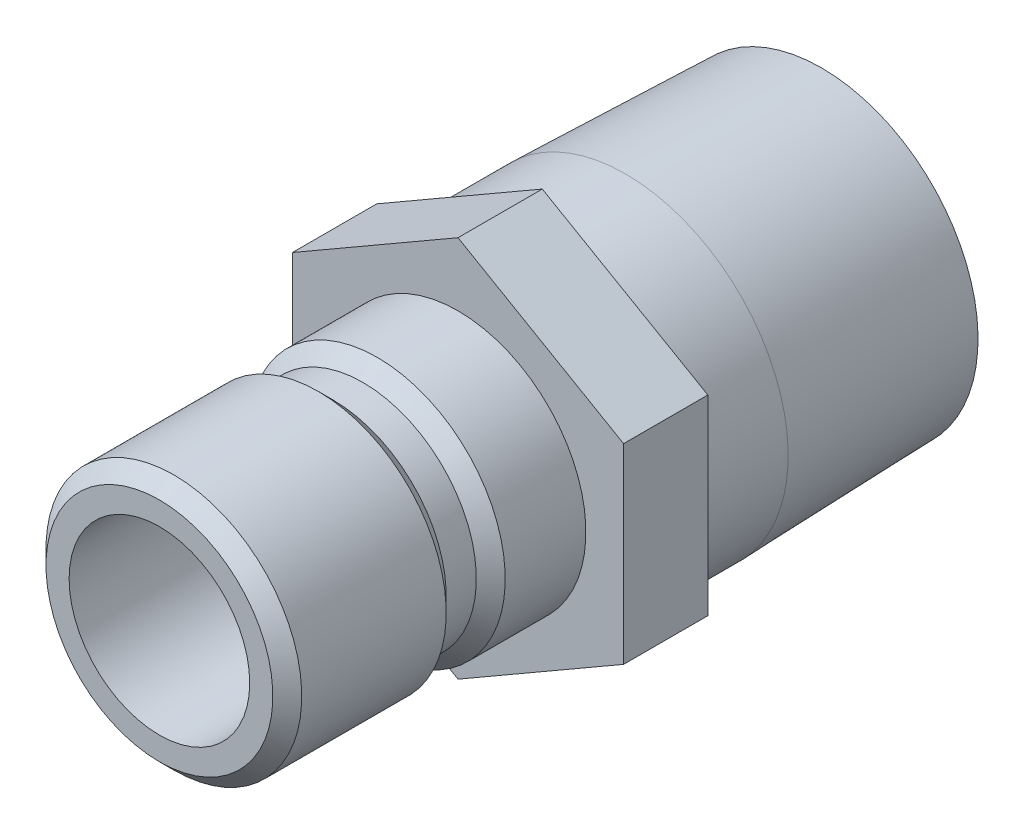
ISO-10303-21;
HEADER;
FILE_DESCRIPTION(('STEP AP214'),'2;1');
FILE_NAME('part.step','',(''),(''),'','','');
FILE_SCHEMA(('AUTOMOTIVE_DESIGN { 1 0 10303 214 1 1 1 1 }'));
ENDSEC;
DATA;
#1=APPLICATION_CONTEXT('core data for automotive mechanical design processes');
#2=APPLICATION_PROTOCOL_DEFINITION('international standard','automotive_design',2000,#1);
#3=PRODUCT_CONTEXT('',#1,'mechanical');
#4=PRODUCT('Part','Part','',(#3));
#5=PRODUCT_RELATED_PRODUCT_CATEGORY('part','',(#4));
#6=PRODUCT_DEFINITION_FORMATION('','',#4);
#7=PRODUCT_DEFINITION_CONTEXT('part definition',#1,'design');
#8=PRODUCT_DEFINITION('design','',#6,#7);
#9=PRODUCT_DEFINITION_SHAPE('','',#8);
#10=(LENGTH_UNIT() NAMED_UNIT(*) SI_UNIT(.MILLI.,.METRE.));
#11=(NAMED_UNIT(*) PLANE_ANGLE_UNIT() SI_UNIT($,.RADIAN.));
#12=(NAMED_UNIT(*) SI_UNIT($,.STERADIAN.) SOLID_ANGLE_UNIT());
#13=UNCERTAINTY_MEASURE_WITH_UNIT(LENGTH_MEASURE(1.E-05),#10,'distance_accuracy_value','');
#14=(GEOMETRIC_REPRESENTATION_CONTEXT(3) GLOBAL_UNCERTAINTY_ASSIGNED_CONTEXT((#13)) GLOBAL_UNIT_ASSIGNED_CONTEXT((#10,
#11,#12)) REPRESENTATION_CONTEXT('',''));
#15=CARTESIAN_POINT('',(0.,0.,0.));
#16=DIRECTION('',(0.,0.,1.));
#17=DIRECTION('',(1.,0.,0.));
#18=AXIS2_PLACEMENT_3D('',#15,#16,#17);
#19=CARTESIAN_POINT('',(0.,0.,0.));
#20=DIRECTION('',(0.,0.,-1.));
#21=DIRECTION('',(0.,1.,0.));
#22=AXIS2_PLACEMENT_3D('',#19,#20,#21);
#23=CYLINDRICAL_SURFACE('',#22,8.5725);
#24=CARTESIAN_POINT('',(0.,0.,-8.8392));
#25=DIRECTION('',(0.,0.,-1.));
#26=DIRECTION('',(0.,1.,0.));
#27=AXIS2_PLACEMENT_3D('',#24,#25,#26);
#28=CIRCLE('',#27,8.5725);
#29=CARTESIAN_POINT('',(0.,8.5725,-8.8392));
#30=VERTEX_POINT('',#29);
#31=EDGE_CURVE('E158',#30,#30,#28,.T.);
#32=ORIENTED_EDGE('',*,*,#31,.F.);
#33=EDGE_LOOP('',(#32));
#34=FACE_BOUND('',#33,.T.);
#35=CARTESIAN_POINT('',(0.,0.,-4.445));
#36=DIRECTION('',(0.,0.,1.));
#37=DIRECTION('',(1.,0.,0.));
#38=AXIS2_PLACEMENT_3D('',#35,#36,#37);
#39=CIRCLE('',#38,8.5725);
#40=CARTESIAN_POINT('',(8.5725,0.,-4.445));
#41=VERTEX_POINT('',#40);
#42=EDGE_CURVE('E138',#41,#41,#39,.F.);
#43=ORIENTED_EDGE('',*,*,#42,.T.);
#44=EDGE_LOOP('',(#43));
#45=FACE_BOUND('',#44,.T.);
#46=ADVANCED_FACE('F33',(#34,#45),#23,.T.);
#47=CARTESIAN_POINT('',(0.,0.,0.));
#48=DIRECTION('',(0.,0.,-1.));
#49=DIRECTION('',(0.,1.,0.));
#50=AXIS2_PLACEMENT_3D('',#47,#48,#49);
#51=CYLINDRICAL_SURFACE('',#50,4.7625);
#52=CARTESIAN_POINT('',(0.,0.,-0.127000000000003));
#53=DIRECTION('',(0.,0.,-1.));
#54=DIRECTION('',(0.,1.,0.));
#55=AXIS2_PLACEMENT_3D('',#52,#53,#54);
#56=CIRCLE('',#55,4.7625);
#57=CARTESIAN_POINT('',(0.,4.7625,-0.127000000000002));
#58=VERTEX_POINT('',#57);
#59=EDGE_CURVE('E146',#58,#58,#56,.T.);
#60=ORIENTED_EDGE('',*,*,#59,.T.);
#61=EDGE_LOOP('',(#60));
#62=FACE_BOUND('',#61,.T.);
#63=CARTESIAN_POINT('',(0.,0.,15.748));
#64=DIRECTION('',(0.,0.,-1.));
#65=DIRECTION('',(0.,1.,0.));
#66=AXIS2_PLACEMENT_3D('',#63,#64,#65);
#67=CIRCLE('',#66,4.7625);
#68=CARTESIAN_POINT('',(0.,4.7625,15.748));
#69=VERTEX_POINT('',#68);
#70=EDGE_CURVE('E11',#69,#69,#67,.T.);
#71=ORIENTED_EDGE('',*,*,#70,.F.);
#72=EDGE_LOOP('',(#71));
#73=FACE_BOUND('',#72,.T.);
#74=ADVANCED_FACE('F35',(#62,#73),#51,.F.);
#75=CARTESIAN_POINT('',(0.,4.7625,15.748));
#76=DIRECTION('',(0.,0.,1.));
#77=DIRECTION('',(0.,-1.,0.));
#78=AXIS2_PLACEMENT_3D('',#75,#76,#77);
#79=PLANE('',#78);
#80=ORIENTED_EDGE('',*,*,#70,.T.);
#81=EDGE_LOOP('',(#80));
#82=FACE_BOUND('',#81,.T.);
#83=CARTESIAN_POINT('',(0.,0.,15.748));
#84=DIRECTION('',(0.,0.,-1.));
#85=DIRECTION('',(0.,1.,0.));
#86=AXIS2_PLACEMENT_3D('',#83,#84,#85);
#87=CIRCLE('',#86,5.9817);
#88=CARTESIAN_POINT('',(0.,5.9817,15.748));
#89=VERTEX_POINT('',#88);
#90=EDGE_CURVE('E42',#89,#89,#87,.T.);
#91=ORIENTED_EDGE('',*,*,#90,.F.);
#92=EDGE_LOOP('',(#91));
#93=FACE_BOUND('',#92,.T.);
#94=ADVANCED_FACE('F184',(#82,#93),#79,.T.);
#95=CARTESIAN_POINT('',(0.,0.,14.986));
#96=DIRECTION('',(0.,0.,-1.));
#97=DIRECTION('',(0.,1.,0.));
#98=AXIS2_PLACEMENT_3D('',#95,#96,#97);
#99=CONICAL_SURFACE('',#98,6.7437,0.785398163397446);
#100=ORIENTED_EDGE('',*,*,#90,.T.);
#101=EDGE_LOOP('',(#100));
#102=FACE_BOUND('',#101,.T.);
#103=CARTESIAN_POINT('',(0.,0.,14.986));
#104=DIRECTION('',(0.,0.,-1.));
#105=DIRECTION('',(0.,1.,0.));
#106=AXIS2_PLACEMENT_3D('',#103,#104,#105);
#107=CIRCLE('',#106,6.7437);
#108=CARTESIAN_POINT('',(0.,6.7437,14.986));
#109=VERTEX_POINT('',#108);
#110=EDGE_CURVE('E176',#109,#109,#107,.T.);
#111=ORIENTED_EDGE('',*,*,#110,.F.);
#112=EDGE_LOOP('',(#111));
#113=FACE_BOUND('',#112,.T.);
#114=ADVANCED_FACE('F181',(#102,#113),#99,.T.);
#115=CARTESIAN_POINT('',(0.,0.,0.));
#116=DIRECTION('',(0.,0.,-1.));
#117=DIRECTION('',(0.,1.,0.));
#118=AXIS2_PLACEMENT_3D('',#115,#116,#117);
#119=CYLINDRICAL_SURFACE('',#118,6.7437);
#120=ORIENTED_EDGE('',*,*,#110,.T.);
#121=EDGE_LOOP('',(#120));
#122=FACE_BOUND('',#121,.T.);
#123=CARTESIAN_POINT('',(0.,0.,7.36599999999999));
#124=DIRECTION('',(0.,0.,-1.));
#125=DIRECTION('',(0.,1.,0.));
#126=AXIS2_PLACEMENT_3D('',#123,#124,#125);
#127=CIRCLE('',#126,6.7437);
#128=CARTESIAN_POINT('',(0.,6.7437,7.36599999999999));
#129=VERTEX_POINT('',#128);
#130=EDGE_CURVE('E173',#129,#129,#127,.T.);
#131=ORIENTED_EDGE('',*,*,#130,.F.);
#132=EDGE_LOOP('',(#131));
#133=FACE_BOUND('',#132,.T.);
#134=ADVANCED_FACE('F191',(#122,#133),#119,.T.);
#135=CARTESIAN_POINT('',(0.,0.,6.604));
#136=DIRECTION('',(0.,0.,1.));
#137=DIRECTION('',(0.,-1.,0.));
#138=AXIS2_PLACEMENT_3D('',#135,#136,#137);
#139=CONICAL_SURFACE('',#138,5.9817,0.785398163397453);
#140=ORIENTED_EDGE('',*,*,#130,.T.);
#141=EDGE_LOOP('',(#140));
#142=FACE_BOUND('',#141,.T.);
#143=CARTESIAN_POINT('',(0.,0.,6.604));
#144=DIRECTION('',(0.,0.,-1.));
#145=DIRECTION('',(0.,1.,0.));
#146=AXIS2_PLACEMENT_3D('',#143,#144,#145);
#147=CIRCLE('',#146,5.9817);
#148=CARTESIAN_POINT('',(0.,5.9817,6.604));
#149=VERTEX_POINT('',#148);
#150=EDGE_CURVE('E170',#149,#149,#147,.T.);
#151=ORIENTED_EDGE('',*,*,#150,.F.);
#152=EDGE_LOOP('',(#151));
#153=FACE_BOUND('',#152,.T.);
#154=ADVANCED_FACE('F220',(#142,#153),#139,.T.);
#155=CARTESIAN_POINT('',(0.,0.,0.));
#156=DIRECTION('',(0.,0.,-1.));
#157=DIRECTION('',(0.,1.,0.));
#158=AXIS2_PLACEMENT_3D('',#155,#156,#157);
#159=CYLINDRICAL_SURFACE('',#158,5.9817);
#160=ORIENTED_EDGE('',*,*,#150,.T.);
#161=EDGE_LOOP('',(#160));
#162=FACE_BOUND('',#161,.T.);
#163=CARTESIAN_POINT('',(0.,0.,5.0165));
#164=DIRECTION('',(0.,0.,-1.));
#165=DIRECTION('',(0.,1.,0.));
#166=AXIS2_PLACEMENT_3D('',#163,#164,#165);
#167=CIRCLE('',#166,5.9817);
#168=CARTESIAN_POINT('',(0.,5.9817,5.0165));
#169=VERTEX_POINT('',#168);
#170=EDGE_CURVE('E167',#169,#169,#167,.T.);
#171=ORIENTED_EDGE('',*,*,#170,.F.);
#172=EDGE_LOOP('',(#171));
#173=FACE_BOUND('',#172,.T.);
#174=ADVANCED_FACE('F216',(#162,#173),#159,.T.);
#175=CARTESIAN_POINT('',(0.,0.,4.25449999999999));
#176=DIRECTION('',(0.,0.,-1.));
#177=DIRECTION('',(0.,1.,0.));
#178=AXIS2_PLACEMENT_3D('',#175,#176,#177);
#179=CONICAL_SURFACE('',#178,6.7437,0.785398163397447);
#180=ORIENTED_EDGE('',*,*,#170,.T.);
#181=EDGE_LOOP('',(#180));
#182=FACE_BOUND('',#181,.T.);
#183=CARTESIAN_POINT('',(0.,0.,4.25449999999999));
#184=DIRECTION('',(0.,0.,-1.));
#185=DIRECTION('',(0.,1.,0.));
#186=AXIS2_PLACEMENT_3D('',#183,#184,#185);
#187=CIRCLE('',#186,6.7437);
#188=CARTESIAN_POINT('',(0.,6.7437,4.25449999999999));
#189=VERTEX_POINT('',#188);
#190=EDGE_CURVE('E164',#189,#189,#187,.T.);
#191=ORIENTED_EDGE('',*,*,#190,.F.);
#192=EDGE_LOOP('',(#191));
#193=FACE_BOUND('',#192,.T.);
#194=ADVANCED_FACE('F212',(#182,#193),#179,.T.);
#195=CARTESIAN_POINT('',(0.,0.,0.));
#196=DIRECTION('',(0.,0.,-1.));
#197=DIRECTION('',(0.,1.,0.));
#198=AXIS2_PLACEMENT_3D('',#195,#196,#197);
#199=CYLINDRICAL_SURFACE('',#198,6.7437);
#200=ORIENTED_EDGE('',*,*,#190,.T.);
#201=EDGE_LOOP('',(#200));
#202=FACE_BOUND('',#201,.T.);
#203=CARTESIAN_POINT('',(0.,0.,0.));
#204=DIRECTION('',(0.,0.,-1.));
#205=DIRECTION('',(0.,1.,0.));
#206=AXIS2_PLACEMENT_3D('',#203,#204,#205);
#207=CIRCLE('',#206,6.7437);
#208=CARTESIAN_POINT('',(0.,6.7437,0.));
#209=VERTEX_POINT('',#208);
#210=EDGE_CURVE('E161',#209,#209,#207,.T.);
#211=ORIENTED_EDGE('',*,*,#210,.F.);
#212=EDGE_LOOP('',(#211));
#213=FACE_BOUND('',#212,.T.);
#214=ADVANCED_FACE('F208',(#202,#213),#199,.T.);
#215=CARTESIAN_POINT('',(0.,6.7437,0.));
#216=DIRECTION('',(0.,0.,1.));
#217=DIRECTION('',(0.,-1.,0.));
#218=AXIS2_PLACEMENT_3D('',#215,#216,#217);
#219=PLANE('',#218);
#220=ORIENTED_EDGE('',*,*,#210,.T.);
#221=EDGE_LOOP('',(#220));
#222=FACE_BOUND('',#221,.T.);
#223=DIRECTION('',(-0.866025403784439,-0.5,0.));
#224=VECTOR('',#223,1.);
#225=CARTESIAN_POINT('',(0.,10.0819790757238,0.));
#226=LINE('',#225,#224);
#227=CARTESIAN_POINT('',(0.,10.0819790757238,0.));
#228=VERTEX_POINT('',#227);
#229=CARTESIAN_POINT('',(-8.73125,5.04098953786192,0.));
#230=VERTEX_POINT('',#229);
#231=EDGE_CURVE('E121',#228,#230,#226,.T.);
#232=ORIENTED_EDGE('',*,*,#231,.T.);
#233=DIRECTION('',(0.,-1.,0.));
#234=VECTOR('',#233,1.);
#235=CARTESIAN_POINT('',(-8.73125,5.04098953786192,0.));
#236=LINE('',#235,#234);
#237=CARTESIAN_POINT('',(-8.73125,-5.04098953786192,0.));
#238=VERTEX_POINT('',#237);
#239=EDGE_CURVE('E124',#230,#238,#236,.T.);
#240=ORIENTED_EDGE('',*,*,#239,.T.);
#241=DIRECTION('',(0.866025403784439,-0.5,0.));
#242=VECTOR('',#241,1.);
#243=CARTESIAN_POINT('',(-8.73125,-5.04098953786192,0.));
#244=LINE('',#243,#242);
#245=CARTESIAN_POINT('',(0.,-10.0819790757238,0.));
#246=VERTEX_POINT('',#245);
#247=EDGE_CURVE('E127',#238,#246,#244,.T.);
#248=ORIENTED_EDGE('',*,*,#247,.T.);
#249=DIRECTION('',(0.866025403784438,0.5,0.));
#250=VECTOR('',#249,1.);
#251=CARTESIAN_POINT('',(0.,-10.0819790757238,0.));
#252=LINE('',#251,#250);
#253=CARTESIAN_POINT('',(8.73125,-5.04098953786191,0.));
#254=VERTEX_POINT('',#253);
#255=EDGE_CURVE('E130',#246,#254,#252,.T.);
#256=ORIENTED_EDGE('',*,*,#255,.T.);
#257=DIRECTION('',(0.,1.,0.));
#258=VECTOR('',#257,1.);
#259=CARTESIAN_POINT('',(8.73125,-5.04098953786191,0.));
#260=LINE('',#259,#258);
#261=CARTESIAN_POINT('',(8.73125,5.04098953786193,0.));
#262=VERTEX_POINT('',#261);
#263=EDGE_CURVE('E98',#254,#262,#260,.T.);
#264=ORIENTED_EDGE('',*,*,#263,.T.);
#265=DIRECTION('',(-0.866025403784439,0.5,0.));
#266=VECTOR('',#265,1.);
#267=CARTESIAN_POINT('',(8.73125,5.04098953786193,0.));
#268=LINE('',#267,#266);
#269=EDGE_CURVE('E133',#262,#228,#268,.T.);
#270=ORIENTED_EDGE('',*,*,#269,.T.);
#271=EDGE_LOOP('',(#232,#240,#248,#256,#264,#270));
#272=FACE_BOUND('',#271,.T.);
#273=ADVANCED_FACE('F205',(#222,#272),#219,.T.);
#274=CARTESIAN_POINT('',(0.,0.,-19.177));
#275=DIRECTION('',(0.,0.,1.));
#276=DIRECTION('',(0.,-1.,0.));
#277=AXIS2_PLACEMENT_3D('',#274,#275,#276);
#278=CONICAL_SURFACE('',#277,8.24944566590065,0.0312396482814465);
#279=ORIENTED_EDGE('',*,*,#31,.T.);
#280=EDGE_LOOP('',(#279));
#281=FACE_BOUND('',#280,.T.);
#282=CARTESIAN_POINT('',(0.,0.,-19.177));
#283=DIRECTION('',(0.,0.,-1.));
#284=DIRECTION('',(0.,1.,0.));
#285=AXIS2_PLACEMENT_3D('',#282,#283,#284);
#286=CIRCLE('',#285,8.24944566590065);
#287=CARTESIAN_POINT('',(0.,8.24944566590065,-19.177));
#288=VERTEX_POINT('',#287);
#289=EDGE_CURVE('E155',#288,#288,#286,.T.);
#290=ORIENTED_EDGE('',*,*,#289,.F.);
#291=EDGE_LOOP('',(#290));
#292=FACE_BOUND('',#291,.T.);
#293=ADVANCED_FACE('F203',(#281,#292),#278,.T.);
#294=CARTESIAN_POINT('',(0.,8.24944566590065,-19.177));
#295=DIRECTION('',(0.,0.,-1.));
#296=DIRECTION('',(0.,1.,0.));
#297=AXIS2_PLACEMENT_3D('',#294,#295,#296);
#298=PLANE('',#297);
#299=ORIENTED_EDGE('',*,*,#289,.T.);
#300=EDGE_LOOP('',(#299));
#301=FACE_BOUND('',#300,.T.);
#302=CARTESIAN_POINT('',(0.,0.,-19.177));
#303=DIRECTION('',(0.,0.,-1.));
#304=DIRECTION('',(0.,1.,0.));
#305=AXIS2_PLACEMENT_3D('',#302,#303,#304);
#306=CIRCLE('',#305,6.2611);
#307=CARTESIAN_POINT('',(0.,6.2611,-19.177));
#308=VERTEX_POINT('',#307);
#309=EDGE_CURVE('E152',#308,#308,#306,.T.);
#310=ORIENTED_EDGE('',*,*,#309,.F.);
#311=EDGE_LOOP('',(#310));
#312=FACE_BOUND('',#311,.T.);
#313=ADVANCED_FACE('F269',(#301,#312),#298,.T.);
#314=CARTESIAN_POINT('',(0.,0.,0.));
#315=DIRECTION('',(0.,0.,-1.));
#316=DIRECTION('',(0.,1.,0.));
#317=AXIS2_PLACEMENT_3D('',#314,#315,#316);
#318=CYLINDRICAL_SURFACE('',#317,6.2611);
#319=CARTESIAN_POINT('',(0.,0.,-0.923819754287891));
#320=DIRECTION('',(0.,0.,-1.));
#321=DIRECTION('',(0.,1.,0.));
#322=AXIS2_PLACEMENT_3D('',#319,#320,#321);
#323=CIRCLE('',#322,6.2611);
#324=CARTESIAN_POINT('',(0.,6.2611,-0.923819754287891));
#325=VERTEX_POINT('',#324);
#326=EDGE_CURVE('E149',#325,#325,#323,.T.);
#327=ORIENTED_EDGE('',*,*,#326,.F.);
#328=EDGE_LOOP('',(#327));
#329=FACE_BOUND('',#328,.T.);
#330=ORIENTED_EDGE('',*,*,#309,.T.);
#331=EDGE_LOOP('',(#330));
#332=FACE_BOUND('',#331,.T.);
#333=ADVANCED_FACE('F266',(#329,#332),#318,.F.);
#334=CARTESIAN_POINT('',(0.,0.,-0.127000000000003));
#335=DIRECTION('',(0.,0.,-1.));
#336=DIRECTION('',(0.,1.,0.));
#337=AXIS2_PLACEMENT_3D('',#334,#335,#336);
#338=CONICAL_SURFACE('',#337,4.7625,1.08210413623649);
#339=ORIENTED_EDGE('',*,*,#326,.T.);
#340=EDGE_LOOP('',(#339));
#341=FACE_BOUND('',#340,.T.);
#342=ORIENTED_EDGE('',*,*,#59,.F.);
#343=EDGE_LOOP('',(#342));
#344=FACE_BOUND('',#343,.T.);
#345=ADVANCED_FACE('F254',(#341,#344),#338,.F.);
#346=CARTESIAN_POINT('',(0.,10.0819790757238,-4.445));
#347=DIRECTION('',(-0.5,0.866025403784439,0.));
#348=DIRECTION('',(-0.866025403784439,-0.5,0.));
#349=AXIS2_PLACEMENT_3D('',#346,#347,#348);
#350=PLANE('',#349);
#351=ORIENTED_EDGE('',*,*,#231,.F.);
#352=DIRECTION('',(0.,0.,1.));
#353=VECTOR('',#352,1.);
#354=CARTESIAN_POINT('',(0.,10.0819790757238,-4.445));
#355=LINE('',#354,#353);
#356=CARTESIAN_POINT('',(0.,10.0819790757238,-4.445));
#357=VERTEX_POINT('',#356);
#358=EDGE_CURVE('E50',#357,#228,#355,.T.);
#359=ORIENTED_EDGE('',*,*,#358,.F.);
#360=DIRECTION('',(-0.866025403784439,-0.5,0.));
#361=VECTOR('',#360,1.);
#362=CARTESIAN_POINT('',(0.,10.0819790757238,-4.445));
#363=LINE('',#362,#361);
#364=CARTESIAN_POINT('',(-8.73125,5.04098953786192,-4.445));
#365=VERTEX_POINT('',#364);
#366=EDGE_CURVE('E136',#357,#365,#363,.T.);
#367=ORIENTED_EDGE('',*,*,#366,.T.);
#368=DIRECTION('',(0.,0.,1.));
#369=VECTOR('',#368,1.);
#370=CARTESIAN_POINT('',(-8.73125,5.04098953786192,-4.445));
#371=LINE('',#370,#369);
#372=EDGE_CURVE('E85',#365,#230,#371,.T.);
#373=ORIENTED_EDGE('',*,*,#372,.T.);
#374=EDGE_LOOP('',(#351,#359,#367,#373));
#375=FACE_BOUND('',#374,.T.);
#376=ADVANCED_FACE('F241',(#375),#350,.T.);
#377=CARTESIAN_POINT('',(8.73125,5.04098953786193,-4.445));
#378=DIRECTION('',(0.5,0.866025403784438,0.));
#379=DIRECTION('',(-0.866025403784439,0.5,0.));
#380=AXIS2_PLACEMENT_3D('',#377,#378,#379);
#381=PLANE('',#380);
#382=ORIENTED_EDGE('',*,*,#269,.F.);
#383=DIRECTION('',(0.,0.,1.));
#384=VECTOR('',#383,1.);
#385=CARTESIAN_POINT('',(8.73125,5.04098953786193,-4.445));
#386=LINE('',#385,#384);
#387=CARTESIAN_POINT('',(8.73125,5.04098953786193,-4.445));
#388=VERTEX_POINT('',#387);
#389=EDGE_CURVE('E73',#388,#262,#386,.T.);
#390=ORIENTED_EDGE('',*,*,#389,.F.);
#391=DIRECTION('',(-0.866025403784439,0.5,0.));
#392=VECTOR('',#391,1.);
#393=CARTESIAN_POINT('',(8.73125,5.04098953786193,-4.445));
#394=LINE('',#393,#392);
#395=EDGE_CURVE('E111',#388,#357,#394,.T.);
#396=ORIENTED_EDGE('',*,*,#395,.T.);
#397=ORIENTED_EDGE('',*,*,#358,.T.);
#398=EDGE_LOOP('',(#382,#390,#396,#397));
#399=FACE_BOUND('',#398,.T.);
#400=ADVANCED_FACE('F246',(#399),#381,.T.);
#401=CARTESIAN_POINT('',(8.73125,-5.04098953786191,-4.445));
#402=DIRECTION('',(1.,0.,0.));
#403=DIRECTION('',(0.,1.,0.));
#404=AXIS2_PLACEMENT_3D('',#401,#402,#403);
#405=PLANE('',#404);
#406=ORIENTED_EDGE('',*,*,#263,.F.);
#407=DIRECTION('',(0.,0.,1.));
#408=VECTOR('',#407,1.);
#409=CARTESIAN_POINT('',(8.73125,-5.04098953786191,-4.445));
#410=LINE('',#409,#408);
#411=CARTESIAN_POINT('',(8.73125,-5.04098953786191,-4.445));
#412=VERTEX_POINT('',#411);
#413=EDGE_CURVE('E93',#412,#254,#410,.T.);
#414=ORIENTED_EDGE('',*,*,#413,.F.);
#415=DIRECTION('',(0.,1.,0.));
#416=VECTOR('',#415,1.);
#417=CARTESIAN_POINT('',(8.73125,-5.04098953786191,-4.445));
#418=LINE('',#417,#416);
#419=EDGE_CURVE('E96',#412,#388,#418,.T.);
#420=ORIENTED_EDGE('',*,*,#419,.T.);
#421=ORIENTED_EDGE('',*,*,#389,.T.);
#422=EDGE_LOOP('',(#406,#414,#420,#421));
#423=FACE_BOUND('',#422,.T.);
#424=ADVANCED_FACE('F95',(#423),#405,.T.);
#425=CARTESIAN_POINT('',(0.,-10.0819790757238,-4.445));
#426=DIRECTION('',(0.5,-0.866025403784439,0.));
#427=DIRECTION('',(0.866025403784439,0.5,0.));
#428=AXIS2_PLACEMENT_3D('',#425,#426,#427);
#429=PLANE('',#428);
#430=ORIENTED_EDGE('',*,*,#255,.F.);
#431=DIRECTION('',(0.,0.,1.));
#432=VECTOR('',#431,1.);
#433=CARTESIAN_POINT('',(0.,-10.0819790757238,-4.445));
#434=LINE('',#433,#432);
#435=CARTESIAN_POINT('',(0.,-10.0819790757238,-4.445));
#436=VERTEX_POINT('',#435);
#437=EDGE_CURVE('E103',#436,#246,#434,.T.);
#438=ORIENTED_EDGE('',*,*,#437,.F.);
#439=DIRECTION('',(0.866025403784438,0.5,0.));
#440=VECTOR('',#439,1.);
#441=CARTESIAN_POINT('',(0.,-10.0819790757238,-4.445));
#442=LINE('',#441,#440);
#443=EDGE_CURVE('E109',#436,#412,#442,.T.);
#444=ORIENTED_EDGE('',*,*,#443,.T.);
#445=ORIENTED_EDGE('',*,*,#413,.T.);
#446=EDGE_LOOP('',(#430,#438,#444,#445));
#447=FACE_BOUND('',#446,.T.);
#448=ADVANCED_FACE('F113',(#447),#429,.T.);
#449=CARTESIAN_POINT('',(-8.73125,-5.04098953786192,-4.445));
#450=DIRECTION('',(-0.5,-0.866025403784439,0.));
#451=DIRECTION('',(0.866025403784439,-0.5,0.));
#452=AXIS2_PLACEMENT_3D('',#449,#450,#451);
#453=PLANE('',#452);
#454=ORIENTED_EDGE('',*,*,#247,.F.);
#455=DIRECTION('',(0.,0.,1.));
#456=VECTOR('',#455,1.);
#457=CARTESIAN_POINT('',(-8.73125,-5.04098953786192,-4.445));
#458=LINE('',#457,#456);
#459=CARTESIAN_POINT('',(-8.73125,-5.04098953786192,-4.445));
#460=VERTEX_POINT('',#459);
#461=EDGE_CURVE('E141',#460,#238,#458,.T.);
#462=ORIENTED_EDGE('',*,*,#461,.F.);
#463=DIRECTION('',(0.866025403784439,-0.5,0.));
#464=VECTOR('',#463,1.);
#465=CARTESIAN_POINT('',(-8.73125,-5.04098953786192,-4.445));
#466=LINE('',#465,#464);
#467=EDGE_CURVE('E114',#460,#436,#466,.T.);
#468=ORIENTED_EDGE('',*,*,#467,.T.);
#469=ORIENTED_EDGE('',*,*,#437,.T.);
#470=EDGE_LOOP('',(#454,#462,#468,#469));
#471=FACE_BOUND('',#470,.T.);
#472=ADVANCED_FACE('F245',(#471),#453,.T.);
#473=CARTESIAN_POINT('',(-8.73125,5.04098953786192,-4.445));
#474=DIRECTION('',(-1.,0.,0.));
#475=DIRECTION('',(0.,0.,1.));
#476=AXIS2_PLACEMENT_3D('',#473,#474,#475);
#477=PLANE('',#476);
#478=ORIENTED_EDGE('',*,*,#239,.F.);
#479=ORIENTED_EDGE('',*,*,#372,.F.);
#480=DIRECTION('',(0.,-1.,0.));
#481=VECTOR('',#480,1.);
#482=CARTESIAN_POINT('',(-8.73125,5.04098953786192,-4.445));
#483=LINE('',#482,#481);
#484=EDGE_CURVE('E116',#365,#460,#483,.T.);
#485=ORIENTED_EDGE('',*,*,#484,.T.);
#486=ORIENTED_EDGE('',*,*,#461,.T.);
#487=EDGE_LOOP('',(#478,#479,#485,#486));
#488=FACE_BOUND('',#487,.T.);
#489=ADVANCED_FACE('F242',(#488),#477,.T.);
#490=CARTESIAN_POINT('',(-8.73125,5.04098953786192,-4.445));
#491=DIRECTION('',(0.,0.,1.));
#492=DIRECTION('',(1.,0.,0.));
#493=AXIS2_PLACEMENT_3D('',#490,#491,#492);
#494=PLANE('',#493);
#495=ORIENTED_EDGE('',*,*,#42,.F.);
#496=EDGE_LOOP('',(#495));
#497=FACE_BOUND('',#496,.T.);
#498=ORIENTED_EDGE('',*,*,#366,.F.);
#499=ORIENTED_EDGE('',*,*,#395,.F.);
#500=ORIENTED_EDGE('',*,*,#419,.F.);
#501=ORIENTED_EDGE('',*,*,#443,.F.);
#502=ORIENTED_EDGE('',*,*,#467,.F.);
#503=ORIENTED_EDGE('',*,*,#484,.F.);
#504=EDGE_LOOP('',(#498,#499,#500,#501,#502,#503));
#505=FACE_BOUND('',#504,.T.);
#506=ADVANCED_FACE('F107',(#497,#505),#494,.F.);
#507=CLOSED_SHELL('',(#46,#74,#94,#114,#134,#154,#174,#194,#214,#273,#293,#313,#333,#345,#376,
#400,#424,#448,#472,#489,#506));
#508=MANIFOLD_SOLID_BREP('B2',#507);
#509=ADVANCED_BREP_SHAPE_REPRESENTATION('',(#18,#508),#14);
#510=SHAPE_DEFINITION_REPRESENTATION(#9,#509);
ENDSEC;
END-ISO-10303-21;
